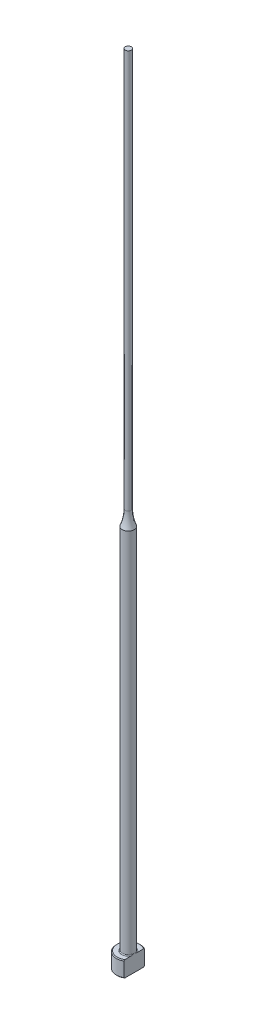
from build123d import *
from build123d.topology import SkipClean

# Parameters (mm, degrees)
CHAMFER1_SIZE    = 0.2
FILLET1_R        = 0.2
KEYED_HEAD_DEPTH = 201.044994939


with BuildPart() as part:
    # Sketch1 → Revolve1 (revolve)
    with BuildSketch(Plane.XY, mode=Mode.PRIVATE) as revolve1_sk:
        with BuildLine():
            Line((0, 0), (-3, 0))
            Line((-3, 0), (-3, 4))
            Line((-3, 4), (-1.5, 4))
            Line((-1.5, 4), (-1.5, 96.200328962))
            ThreePointArc((-1.5, 96.200328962), (-0.939291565, 98.063508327), (-0.75, 100))
            Line((-0.75, 100), (-0.75, 200))
            Line((-0.75, 200), (0, 200))
            Line((0, 200), (0, 0))
        make_face()
    revolve(revolve1_sk.sketch.rotate(Axis((0, 259.958771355, 0), (0, -1, 0)), 270), axis=Axis((0, 259.958771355, 0), (0, -1, 0)))

    # Chamfer1
    chamfer1_edges = [part.edges().sort_by_distance(p)[0] for p in [
        (0, 0, -3),
        (0, 4, -3),
    ]]
    chamfer(chamfer1_edges, length=CHAMFER1_SIZE)

    # Fillet1
    fillet1_edges = [part.edges().sort_by_distance(p)[0] for p in [
        (0, 4, -1.5),
    ]]
    fillet(fillet1_edges, radius=FILLET1_R)

    # Sketch2 → Keyed Head (cut, through all)
    with SkipClean():  # the faces are left unmerged after this step: merging them gives an invalid solid
        with BuildSketch(Plane(origin=(0, 0, 0), x_dir=(1, 0, 0), z_dir=(0, 1, 0))):
            with BuildLine():
                Line((1.5, -2.598076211), (1.5, 2.598076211))
                ThreePointArc((1.5, 2.598076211), (3, 0), (1.5, -2.598076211))
            make_face()
        extrude(amount=KEYED_HEAD_DEPTH, mode=Mode.SUBTRACT)


solid = part.part
